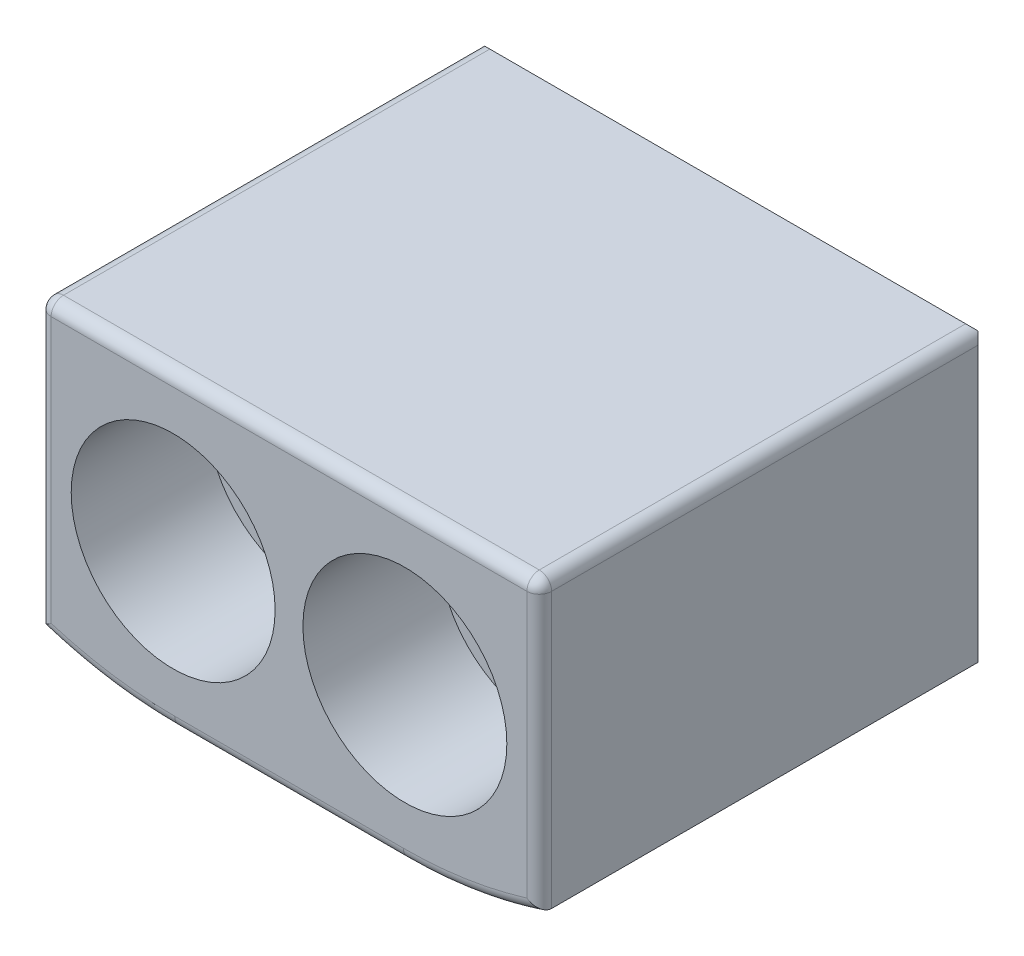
from build123d import *

# Parameters (mm, degrees)
BOSS_EXTRUDE1_DEPTH = 19.05
SKETCH3_R           = 2.794
CUT_EXTRUDE1_DEPTH  = 26.100096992
SKETCH4_R           = 4.191
CUT_EXTRUDE2_DEPTH  = 5.588
CHAMFER3_SIZE       = 1.016
FILLET3_R           = 0.508


with BuildPart() as part:
    # Sketch1 → Boss-Extrude1 (new body)
    with BuildSketch(Plane.XY):
        with BuildLine():
            Line((-4.699, -12.7), (4.699, -12.7))
            ThreePointArc((4.699, -12.7), (7.529081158, -12.473319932), (10.287, -11.799059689))
            Line((10.287, -11.799059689), (10.287, 0))
            Line((10.287, 0), (-10.287, 0))
            Line((-10.287, 0), (-10.287, -11.799059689))
            ThreePointArc((-10.287, -11.799059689), (-7.529081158, -12.473319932), (-4.699, -12.7))
        make_face()
    extrude(amount=-BOSS_EXTRUDE1_DEPTH)

    # Sketch3 → Cut-Extrude1 (cut, through all)
    with BuildSketch(Plane.XY):
        with Locations((4.7625, -6.35)):
            Circle(SKETCH3_R)
        with Locations((-4.7625, -6.35)):
            Circle(SKETCH3_R)
    extrude(amount=-CUT_EXTRUDE1_DEPTH, mode=Mode.SUBTRACT)

    # Sketch4 → Cut-Extrude2 (cut)
    with BuildSketch(Plane.XY):
        with Locations((4.7625, -6.35)):
            Circle(SKETCH4_R)
        with Locations((-4.7625, -6.35)):
            Circle(SKETCH4_R)
    extrude(amount=-CUT_EXTRUDE2_DEPTH, mode=Mode.SUBTRACT)

    # Chamfer3
    chamfer3_edges = [part.edges().sort_by_distance(p)[0] for p in [
        (7.529081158, -12.473319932, -19.05),
        (10.287, -5.899529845, -19.05),
        (0, 0, -19.05),
        (-10.287, -5.899529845, -19.05),
        (-7.529081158, -12.473319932, -19.05),
        (0, -12.7, -19.05),
    ]]
    chamfer(chamfer3_edges, length=CHAMFER3_SIZE)

    # Fillet3
    fillet3_edges = [part.edges().sort_by_distance(p)[0] for p in [
        (10.287, 0, -9.017),
        (-10.287, 0, -9.017),
        (-10.287, -5.899529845, 0),
        (0, 0, 0),
        (10.287, -5.899529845, 0),
        (7.529081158, -12.473319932, 0),
        (0, -12.7, 0),
        (-7.529081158, -12.473319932, 0),
    ]]
    fillet(fillet3_edges, radius=FILLET3_R)


solid = part.part
